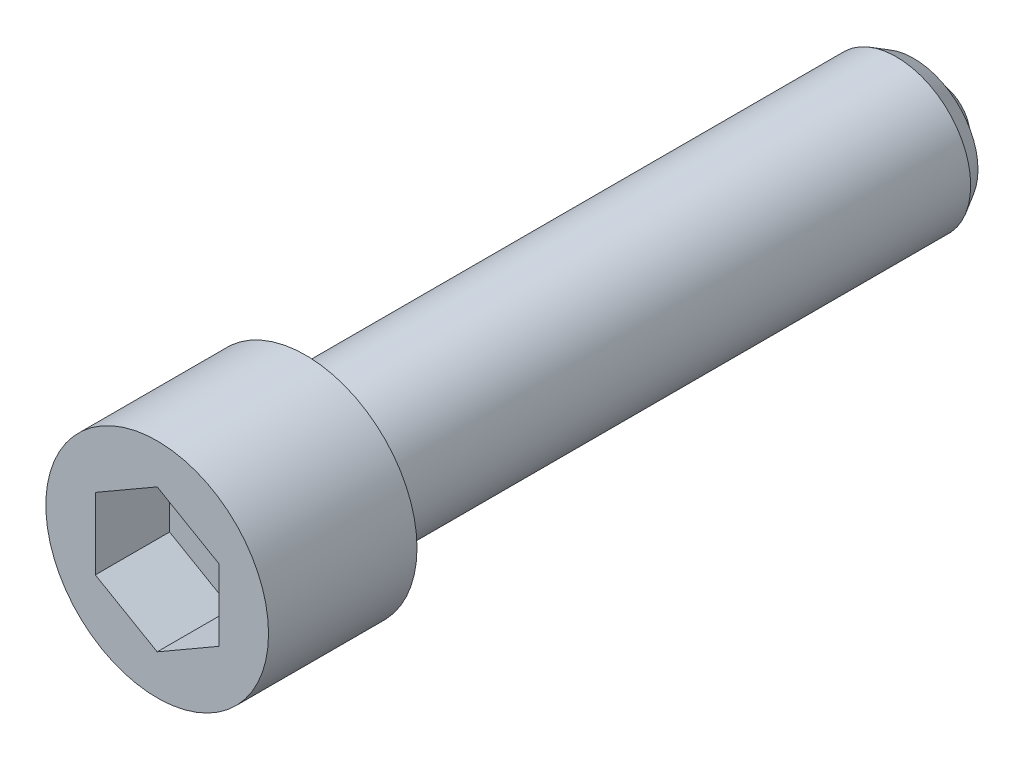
ISO-10303-21;
HEADER;
FILE_DESCRIPTION(('STEP AP214'),'2;1');
FILE_NAME('part.step','',(''),(''),'','','');
FILE_SCHEMA(('AUTOMOTIVE_DESIGN { 1 0 10303 214 1 1 1 1 }'));
ENDSEC;
DATA;
#1=APPLICATION_CONTEXT('core data for automotive mechanical design processes');
#2=APPLICATION_PROTOCOL_DEFINITION('international standard','automotive_design',2000,#1);
#3=PRODUCT_CONTEXT('',#1,'mechanical');
#4=PRODUCT('Part','Part','',(#3));
#5=PRODUCT_RELATED_PRODUCT_CATEGORY('part','',(#4));
#6=PRODUCT_DEFINITION_FORMATION('','',#4);
#7=PRODUCT_DEFINITION_CONTEXT('part definition',#1,'design');
#8=PRODUCT_DEFINITION('design','',#6,#7);
#9=PRODUCT_DEFINITION_SHAPE('','',#8);
#10=(LENGTH_UNIT() NAMED_UNIT(*) SI_UNIT(.MILLI.,.METRE.));
#11=(NAMED_UNIT(*) PLANE_ANGLE_UNIT() SI_UNIT($,.RADIAN.));
#12=(NAMED_UNIT(*) SI_UNIT($,.STERADIAN.) SOLID_ANGLE_UNIT());
#13=UNCERTAINTY_MEASURE_WITH_UNIT(LENGTH_MEASURE(1.E-05),#10,'distance_accuracy_value','');
#14=(GEOMETRIC_REPRESENTATION_CONTEXT(3) GLOBAL_UNCERTAINTY_ASSIGNED_CONTEXT((#13)) GLOBAL_UNIT_ASSIGNED_CONTEXT((#10,
#11,#12)) REPRESENTATION_CONTEXT('',''));
#15=CARTESIAN_POINT('',(0.,0.,0.));
#16=DIRECTION('',(0.,0.,1.));
#17=DIRECTION('',(1.,0.,0.));
#18=AXIS2_PLACEMENT_3D('',#15,#16,#17);
#19=CARTESIAN_POINT('',(0.,0.,4.35));
#20=DIRECTION('',(0.,0.,-1.));
#21=DIRECTION('',(1.,0.,0.));
#22=AXIS2_PLACEMENT_3D('',#19,#20,#21);
#23=SPHERICAL_SURFACE('',#22,4.35);
#24=CARTESIAN_POINT('',(0.,0.,2.85));
#25=DIRECTION('',(0.,0.,-1.));
#26=DIRECTION('',(1.,0.,0.));
#27=AXIS2_PLACEMENT_3D('',#24,#25,#26);
#28=CIRCLE('',#27,4.08319727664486);
#29=CARTESIAN_POINT('',(4.08319727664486,0.,2.85));
#30=VERTEX_POINT('',#29);
#31=EDGE_CURVE('E9',#30,#30,#28,.T.);
#32=ORIENTED_EDGE('',*,*,#31,.T.);
#33=EDGE_LOOP('',(#32));
#34=FACE_BOUND('',#33,.T.);
#35=ADVANCED_FACE('F15',(#34),#23,.T.);
#36=CARTESIAN_POINT('',(5.19170962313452,0.,2.85));
#37=DIRECTION('',(0.,0.,1.));
#38=DIRECTION('',(-1.,0.,0.));
#39=AXIS2_PLACEMENT_3D('',#36,#37,#38);
#40=PLANE('',#39);
#41=ORIENTED_EDGE('',*,*,#31,.F.);
#42=EDGE_LOOP('',(#41));
#43=FACE_BOUND('',#42,.T.);
#44=CARTESIAN_POINT('',(0.,0.,2.85));
#45=DIRECTION('',(0.,0.,-1.));
#46=DIRECTION('',(1.,0.,0.));
#47=AXIS2_PLACEMENT_3D('',#44,#45,#46);
#48=CIRCLE('',#47,5.19170962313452);
#49=CARTESIAN_POINT('',(5.19170962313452,0.,2.85));
#50=VERTEX_POINT('',#49);
#51=EDGE_CURVE('E22',#50,#50,#48,.T.);
#52=ORIENTED_EDGE('',*,*,#51,.T.);
#53=EDGE_LOOP('',(#52));
#54=FACE_BOUND('',#53,.T.);
#55=ADVANCED_FACE('F136',(#43,#54),#40,.F.);
#56=CARTESIAN_POINT('',(0.,0.,4.25));
#57=DIRECTION('',(0.,0.,1.));
#58=DIRECTION('',(-1.,0.,0.));
#59=AXIS2_PLACEMENT_3D('',#56,#57,#58);
#60=CONICAL_SURFACE('',#59,6.,0.523598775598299);
#61=ORIENTED_EDGE('',*,*,#51,.F.);
#62=EDGE_LOOP('',(#61));
#63=FACE_BOUND('',#62,.T.);
#64=CARTESIAN_POINT('',(0.,0.,4.25));
#65=DIRECTION('',(0.,0.,-1.));
#66=DIRECTION('',(1.,0.,0.));
#67=AXIS2_PLACEMENT_3D('',#64,#65,#66);
#68=CIRCLE('',#67,6.);
#69=CARTESIAN_POINT('',(6.,0.,4.25));
#70=VERTEX_POINT('',#69);
#71=EDGE_CURVE('E131',#70,#70,#68,.T.);
#72=ORIENTED_EDGE('',*,*,#71,.T.);
#73=EDGE_LOOP('',(#72));
#74=FACE_BOUND('',#73,.T.);
#75=ADVANCED_FACE('F138',(#63,#74),#60,.T.);
#76=CARTESIAN_POINT('',(0.,0.,-8.));
#77=DIRECTION('',(0.,0.,-1.));
#78=DIRECTION('',(1.,0.,0.));
#79=AXIS2_PLACEMENT_3D('',#76,#77,#78);
#80=CYLINDRICAL_SURFACE('',#79,6.);
#81=CARTESIAN_POINT('',(0.,0.,52.));
#82=DIRECTION('',(0.,0.,-1.));
#83=DIRECTION('',(1.,0.,0.));
#84=AXIS2_PLACEMENT_3D('',#81,#82,#83);
#85=CIRCLE('',#84,6.);
#86=CARTESIAN_POINT('',(6.,0.,52.));
#87=VERTEX_POINT('',#86);
#88=EDGE_CURVE('E128',#87,#87,#85,.T.);
#89=ORIENTED_EDGE('',*,*,#88,.T.);
#90=EDGE_LOOP('',(#89));
#91=FACE_BOUND('',#90,.T.);
#92=ORIENTED_EDGE('',*,*,#71,.F.);
#93=EDGE_LOOP('',(#92));
#94=FACE_BOUND('',#93,.T.);
#95=ADVANCED_FACE('F141',(#91,#94),#80,.T.);
#96=CARTESIAN_POINT('',(6.,0.,52.));
#97=DIRECTION('',(0.,0.,-1.));
#98=DIRECTION('',(1.,0.,0.));
#99=AXIS2_PLACEMENT_3D('',#96,#97,#98);
#100=PLANE('',#99);
#101=CARTESIAN_POINT('',(0.,0.,52.));
#102=DIRECTION('',(0.,0.,-1.));
#103=DIRECTION('',(1.,0.,0.));
#104=AXIS2_PLACEMENT_3D('',#101,#102,#103);
#105=CIRCLE('',#104,9.);
#106=CARTESIAN_POINT('',(9.,0.,52.));
#107=VERTEX_POINT('',#106);
#108=EDGE_CURVE('E125',#107,#107,#105,.T.);
#109=ORIENTED_EDGE('',*,*,#108,.T.);
#110=EDGE_LOOP('',(#109));
#111=FACE_BOUND('',#110,.T.);
#112=ORIENTED_EDGE('',*,*,#88,.F.);
#113=EDGE_LOOP('',(#112));
#114=FACE_BOUND('',#113,.T.);
#115=ADVANCED_FACE('F146',(#111,#114),#100,.T.);
#116=CARTESIAN_POINT('',(0.,0.,-8.));
#117=DIRECTION('',(0.,0.,-1.));
#118=DIRECTION('',(1.,0.,0.));
#119=AXIS2_PLACEMENT_3D('',#116,#117,#118);
#120=CYLINDRICAL_SURFACE('',#119,9.);
#121=CARTESIAN_POINT('',(0.,0.,64.));
#122=DIRECTION('',(0.,0.,-1.));
#123=DIRECTION('',(1.,0.,0.));
#124=AXIS2_PLACEMENT_3D('',#121,#122,#123);
#125=CIRCLE('',#124,9.);
#126=CARTESIAN_POINT('',(9.,0.,64.));
#127=VERTEX_POINT('',#126);
#128=EDGE_CURVE('E122',#127,#127,#125,.T.);
#129=ORIENTED_EDGE('',*,*,#128,.T.);
#130=EDGE_LOOP('',(#129));
#131=FACE_BOUND('',#130,.T.);
#132=ORIENTED_EDGE('',*,*,#108,.F.);
#133=EDGE_LOOP('',(#132));
#134=FACE_BOUND('',#133,.T.);
#135=ADVANCED_FACE('F153',(#131,#134),#120,.T.);
#136=CARTESIAN_POINT('',(9.,0.,64.));
#137=DIRECTION('',(0.,0.,1.));
#138=DIRECTION('',(-1.,0.,0.));
#139=AXIS2_PLACEMENT_3D('',#136,#137,#138);
#140=PLANE('',#139);
#141=DIRECTION('',(-0.86602540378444,0.5,0.));
#142=VECTOR('',#141,1.);
#143=CARTESIAN_POINT('',(5.,2.88675134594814,64.));
#144=LINE('',#143,#142);
#145=CARTESIAN_POINT('',(5.,2.88675134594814,64.));
#146=VERTEX_POINT('',#145);
#147=CARTESIAN_POINT('',(0.,5.77350269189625,64.));
#148=VERTEX_POINT('',#147);
#149=EDGE_CURVE('E29',#146,#148,#144,.T.);
#150=ORIENTED_EDGE('',*,*,#149,.F.);
#151=DIRECTION('',(0.,1.,0.));
#152=VECTOR('',#151,1.);
#153=CARTESIAN_POINT('',(5.,-2.88675134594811,64.));
#154=LINE('',#153,#152);
#155=CARTESIAN_POINT('',(5.,-2.88675134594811,64.));
#156=VERTEX_POINT('',#155);
#157=EDGE_CURVE('E98',#156,#146,#154,.T.);
#158=ORIENTED_EDGE('',*,*,#157,.F.);
#159=DIRECTION('',(-0.866025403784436,-0.5,0.));
#160=VECTOR('',#159,1.);
#161=CARTESIAN_POINT('',(5.,-2.88675134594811,64.));
#162=LINE('',#161,#160);
#163=CARTESIAN_POINT('',(0.,-5.77350269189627,64.));
#164=VERTEX_POINT('',#163);
#165=EDGE_CURVE('E93',#156,#164,#162,.T.);
#166=ORIENTED_EDGE('',*,*,#165,.T.);
#167=DIRECTION('',(0.866025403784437,-0.5,0.));
#168=VECTOR('',#167,1.);
#169=CARTESIAN_POINT('',(-5.,-2.88675134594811,64.));
#170=LINE('',#169,#168);
#171=CARTESIAN_POINT('',(-5.,-2.88675134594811,64.));
#172=VERTEX_POINT('',#171);
#173=EDGE_CURVE('E91',#172,#164,#170,.T.);
#174=ORIENTED_EDGE('',*,*,#173,.F.);
#175=DIRECTION('',(0.,1.,0.));
#176=VECTOR('',#175,1.);
#177=CARTESIAN_POINT('',(-5.,-2.88675134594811,64.));
#178=LINE('',#177,#176);
#179=CARTESIAN_POINT('',(-5.,2.88675134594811,64.));
#180=VERTEX_POINT('',#179);
#181=EDGE_CURVE('E72',#172,#180,#178,.T.);
#182=ORIENTED_EDGE('',*,*,#181,.T.);
#183=DIRECTION('',(0.866025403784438,0.5,0.));
#184=VECTOR('',#183,1.);
#185=CARTESIAN_POINT('',(-5.,2.88675134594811,64.));
#186=LINE('',#185,#184);
#187=EDGE_CURVE('E83',#180,#148,#186,.T.);
#188=ORIENTED_EDGE('',*,*,#187,.T.);
#189=EDGE_LOOP('',(#150,#158,#166,#174,#182,#188));
#190=FACE_BOUND('',#189,.T.);
#191=ORIENTED_EDGE('',*,*,#128,.F.);
#192=EDGE_LOOP('',(#191));
#193=FACE_BOUND('',#192,.T.);
#194=ADVANCED_FACE('F87',(#190,#193),#140,.T.);
#195=CARTESIAN_POINT('',(5.,2.88675134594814,58.));
#196=DIRECTION('',(0.5,0.86602540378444,0.));
#197=DIRECTION('',(0.86602540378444,-0.5,0.));
#198=AXIS2_PLACEMENT_3D('',#195,#196,#197);
#199=PLANE('',#198);
#200=DIRECTION('',(0.,0.,1.));
#201=VECTOR('',#200,1.);
#202=CARTESIAN_POINT('',(5.,2.88675134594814,58.));
#203=LINE('',#202,#201);
#204=CARTESIAN_POINT('',(5.,2.88675134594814,58.));
#205=VERTEX_POINT('',#204);
#206=EDGE_CURVE('E36',#205,#146,#203,.T.);
#207=ORIENTED_EDGE('',*,*,#206,.T.);
#208=ORIENTED_EDGE('',*,*,#149,.T.);
#209=DIRECTION('',(0.,0.,1.));
#210=VECTOR('',#209,1.);
#211=CARTESIAN_POINT('',(0.,5.77350269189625,58.));
#212=LINE('',#211,#210);
#213=CARTESIAN_POINT('',(0.,5.77350269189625,58.));
#214=VERTEX_POINT('',#213);
#215=EDGE_CURVE('E80',#214,#148,#212,.T.);
#216=ORIENTED_EDGE('',*,*,#215,.F.);
#217=DIRECTION('',(-0.86602540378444,0.5,0.));
#218=VECTOR('',#217,1.);
#219=CARTESIAN_POINT('',(5.,2.88675134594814,58.));
#220=LINE('',#219,#218);
#221=EDGE_CURVE('E100',#205,#214,#220,.T.);
#222=ORIENTED_EDGE('',*,*,#221,.F.);
#223=EDGE_LOOP('',(#207,#208,#216,#222));
#224=FACE_BOUND('',#223,.T.);
#225=ADVANCED_FACE('F205',(#224),#199,.F.);
#226=CARTESIAN_POINT('',(5.,-2.88675134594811,58.));
#227=DIRECTION('',(1.,0.,0.));
#228=DIRECTION('',(0.,-1.,0.));
#229=AXIS2_PLACEMENT_3D('',#226,#227,#228);
#230=PLANE('',#229);
#231=DIRECTION('',(0.,0.,1.));
#232=VECTOR('',#231,1.);
#233=CARTESIAN_POINT('',(5.,-2.88675134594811,58.));
#234=LINE('',#233,#232);
#235=CARTESIAN_POINT('',(5.,-2.88675134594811,58.));
#236=VERTEX_POINT('',#235);
#237=EDGE_CURVE('E119',#236,#156,#234,.T.);
#238=ORIENTED_EDGE('',*,*,#237,.T.);
#239=ORIENTED_EDGE('',*,*,#157,.T.);
#240=ORIENTED_EDGE('',*,*,#206,.F.);
#241=DIRECTION('',(0.,1.,0.));
#242=VECTOR('',#241,1.);
#243=CARTESIAN_POINT('',(5.,-2.88675134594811,58.));
#244=LINE('',#243,#242);
#245=EDGE_CURVE('E112',#236,#205,#244,.T.);
#246=ORIENTED_EDGE('',*,*,#245,.F.);
#247=EDGE_LOOP('',(#238,#239,#240,#246));
#248=FACE_BOUND('',#247,.T.);
#249=ADVANCED_FACE('F214',(#248),#230,.F.);
#250=CARTESIAN_POINT('',(5.,-2.88675134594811,58.));
#251=DIRECTION('',(-0.5,0.866025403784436,0.));
#252=DIRECTION('',(0.866025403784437,0.5,0.));
#253=AXIS2_PLACEMENT_3D('',#250,#251,#252);
#254=PLANE('',#253);
#255=DIRECTION('',(0.,0.,1.));
#256=VECTOR('',#255,1.);
#257=CARTESIAN_POINT('',(0.,-5.77350269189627,58.));
#258=LINE('',#257,#256);
#259=CARTESIAN_POINT('',(0.,-5.77350269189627,58.));
#260=VERTEX_POINT('',#259);
#261=EDGE_CURVE('E117',#260,#164,#258,.T.);
#262=ORIENTED_EDGE('',*,*,#261,.T.);
#263=ORIENTED_EDGE('',*,*,#165,.F.);
#264=ORIENTED_EDGE('',*,*,#237,.F.);
#265=DIRECTION('',(-0.866025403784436,-0.5,0.));
#266=VECTOR('',#265,1.);
#267=CARTESIAN_POINT('',(5.,-2.88675134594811,58.));
#268=LINE('',#267,#266);
#269=EDGE_CURVE('E109',#236,#260,#268,.T.);
#270=ORIENTED_EDGE('',*,*,#269,.T.);
#271=EDGE_LOOP('',(#262,#263,#264,#270));
#272=FACE_BOUND('',#271,.T.);
#273=ADVANCED_FACE('F223',(#272),#254,.T.);
#274=CARTESIAN_POINT('',(-5.,-2.88675134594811,58.));
#275=DIRECTION('',(-0.5,-0.866025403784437,0.));
#276=DIRECTION('',(-0.866025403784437,0.5,0.));
#277=AXIS2_PLACEMENT_3D('',#274,#275,#276);
#278=PLANE('',#277);
#279=DIRECTION('',(0.,0.,1.));
#280=VECTOR('',#279,1.);
#281=CARTESIAN_POINT('',(-5.,-2.88675134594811,58.));
#282=LINE('',#281,#280);
#283=CARTESIAN_POINT('',(-5.,-2.88675134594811,58.));
#284=VERTEX_POINT('',#283);
#285=EDGE_CURVE('E79',#284,#172,#282,.T.);
#286=ORIENTED_EDGE('',*,*,#285,.T.);
#287=ORIENTED_EDGE('',*,*,#173,.T.);
#288=ORIENTED_EDGE('',*,*,#261,.F.);
#289=DIRECTION('',(0.866025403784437,-0.5,0.));
#290=VECTOR('',#289,1.);
#291=CARTESIAN_POINT('',(-5.,-2.88675134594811,58.));
#292=LINE('',#291,#290);
#293=EDGE_CURVE('E106',#284,#260,#292,.T.);
#294=ORIENTED_EDGE('',*,*,#293,.F.);
#295=EDGE_LOOP('',(#286,#287,#288,#294));
#296=FACE_BOUND('',#295,.T.);
#297=ADVANCED_FACE('F232',(#296),#278,.F.);
#298=CARTESIAN_POINT('',(-5.,-2.88675134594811,58.));
#299=DIRECTION('',(1.,0.,0.));
#300=DIRECTION('',(0.,-1.,0.));
#301=AXIS2_PLACEMENT_3D('',#298,#299,#300);
#302=PLANE('',#301);
#303=DIRECTION('',(0.,0.,1.));
#304=VECTOR('',#303,1.);
#305=CARTESIAN_POINT('',(-5.,2.88675134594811,58.));
#306=LINE('',#305,#304);
#307=CARTESIAN_POINT('',(-5.,2.88675134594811,58.));
#308=VERTEX_POINT('',#307);
#309=EDGE_CURVE('E68',#308,#180,#306,.T.);
#310=ORIENTED_EDGE('',*,*,#309,.T.);
#311=ORIENTED_EDGE('',*,*,#181,.F.);
#312=ORIENTED_EDGE('',*,*,#285,.F.);
#313=DIRECTION('',(0.,1.,0.));
#314=VECTOR('',#313,1.);
#315=CARTESIAN_POINT('',(-5.,-2.88675134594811,58.));
#316=LINE('',#315,#314);
#317=EDGE_CURVE('E75',#284,#308,#316,.T.);
#318=ORIENTED_EDGE('',*,*,#317,.T.);
#319=EDGE_LOOP('',(#310,#311,#312,#318));
#320=FACE_BOUND('',#319,.T.);
#321=ADVANCED_FACE('F70',(#320),#302,.T.);
#322=CARTESIAN_POINT('',(-5.,2.88675134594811,58.));
#323=DIRECTION('',(0.5,-0.866025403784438,0.));
#324=DIRECTION('',(-0.866025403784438,-0.5,0.));
#325=AXIS2_PLACEMENT_3D('',#322,#323,#324);
#326=PLANE('',#325);
#327=DIRECTION('',(0.866025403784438,0.5,0.));
#328=VECTOR('',#327,1.);
#329=CARTESIAN_POINT('',(-5.,2.88675134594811,58.));
#330=LINE('',#329,#328);
#331=EDGE_CURVE('E103',#308,#214,#330,.T.);
#332=ORIENTED_EDGE('',*,*,#331,.T.);
#333=ORIENTED_EDGE('',*,*,#215,.T.);
#334=ORIENTED_EDGE('',*,*,#187,.F.);
#335=ORIENTED_EDGE('',*,*,#309,.F.);
#336=EDGE_LOOP('',(#332,#333,#334,#335));
#337=FACE_BOUND('',#336,.T.);
#338=ADVANCED_FACE('F84',(#337),#326,.T.);
#339=CARTESIAN_POINT('',(-5.,8.66025403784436,58.));
#340=DIRECTION('',(0.,0.,-1.));
#341=DIRECTION('',(1.,0.,0.));
#342=AXIS2_PLACEMENT_3D('',#339,#340,#341);
#343=PLANE('',#342);
#344=ORIENTED_EDGE('',*,*,#221,.T.);
#345=ORIENTED_EDGE('',*,*,#331,.F.);
#346=ORIENTED_EDGE('',*,*,#317,.F.);
#347=ORIENTED_EDGE('',*,*,#293,.T.);
#348=ORIENTED_EDGE('',*,*,#269,.F.);
#349=ORIENTED_EDGE('',*,*,#245,.T.);
#350=EDGE_LOOP('',(#344,#345,#346,#347,#348,#349));
#351=FACE_BOUND('',#350,.T.);
#352=ADVANCED_FACE('F252',(#351),#343,.F.);
#353=CLOSED_SHELL('',(#35,#55,#75,#95,#115,#135,#194,#225,#249,#273,#297,#321,#338,#352));
#354=MANIFOLD_SOLID_BREP('B1',#353);
#355=ADVANCED_BREP_SHAPE_REPRESENTATION('',(#18,#354),#14);
#356=SHAPE_DEFINITION_REPRESENTATION(#9,#355);
ENDSEC;
END-ISO-10303-21;
